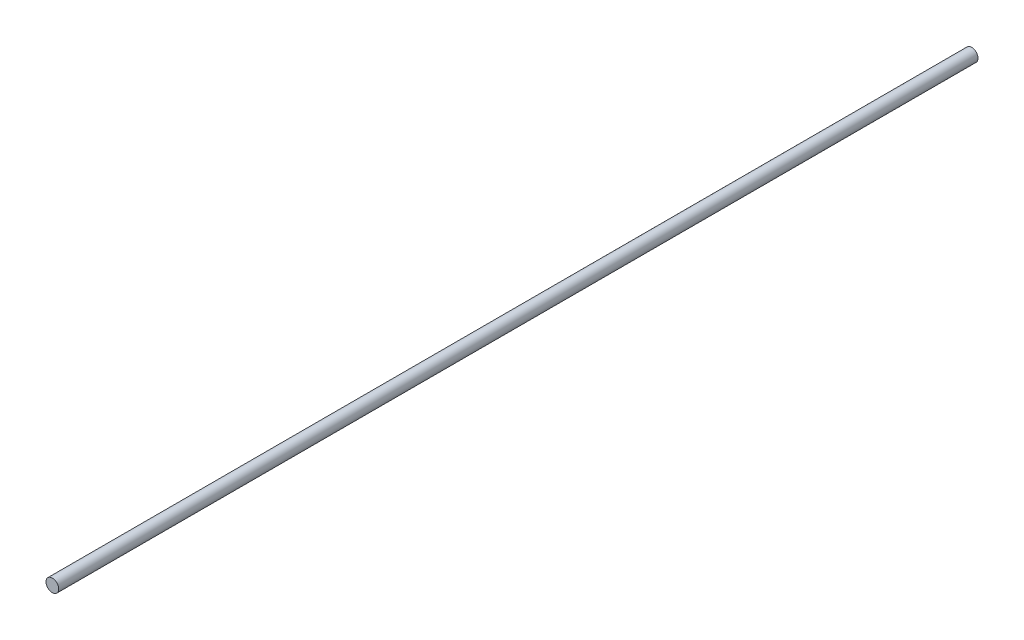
from build123d import *

# Parameters (mm, degrees)
SKETCH1_R           = 30
BOSS_EXTRUDE1_DEPTH = 4350


with BuildPart() as part:
    # Sketch1 → Boss-Extrude1 (new body)
    with BuildSketch(Plane.XY):
        Circle(SKETCH1_R)
    extrude(amount=-BOSS_EXTRUDE1_DEPTH)


solid = part.part
